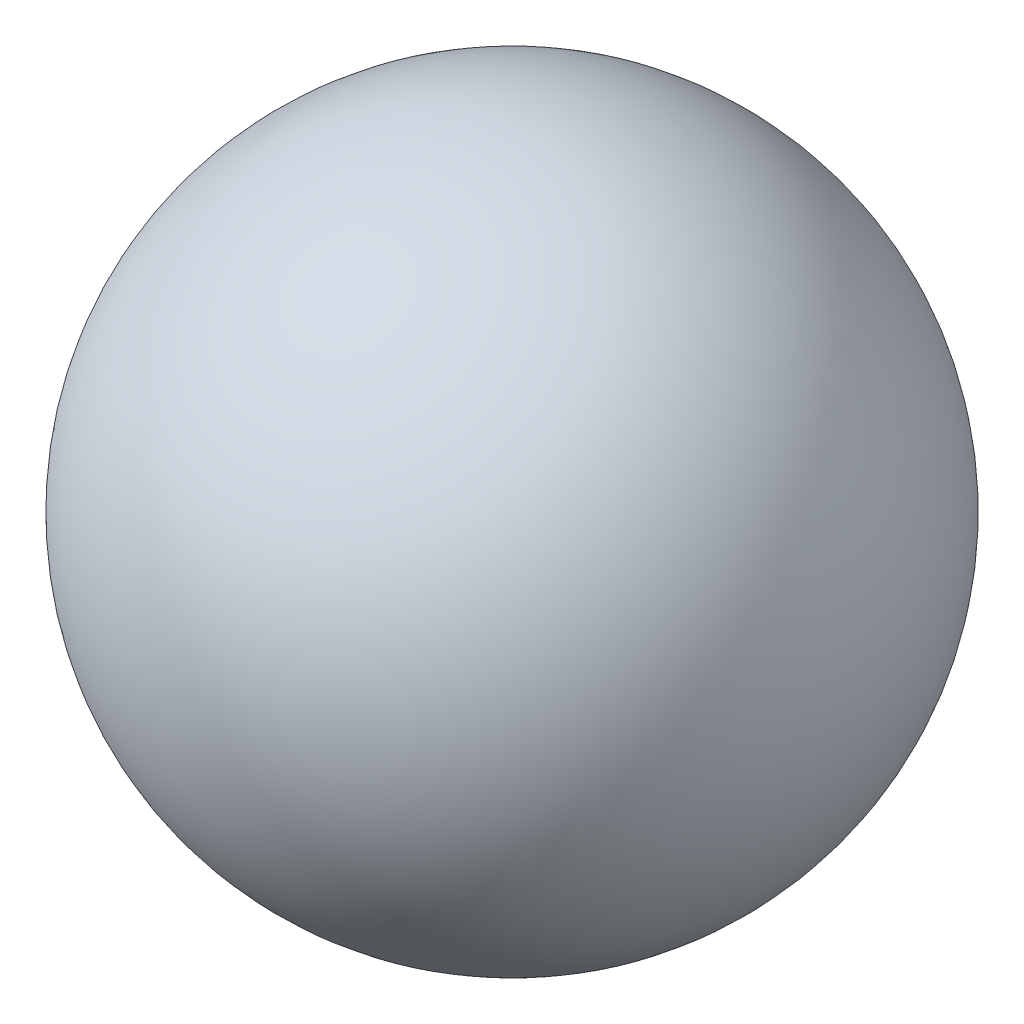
ISO-10303-21;
HEADER;
FILE_DESCRIPTION(('STEP AP214'),'2;1');
FILE_NAME('part.step','',(''),(''),'','','');
FILE_SCHEMA(('AUTOMOTIVE_DESIGN { 1 0 10303 214 1 1 1 1 }'));
ENDSEC;
DATA;
#1=APPLICATION_CONTEXT('core data for automotive mechanical design processes');
#2=APPLICATION_PROTOCOL_DEFINITION('international standard','automotive_design',2000,#1);
#3=PRODUCT_CONTEXT('',#1,'mechanical');
#4=PRODUCT('Part','Part','',(#3));
#5=PRODUCT_RELATED_PRODUCT_CATEGORY('part','',(#4));
#6=PRODUCT_DEFINITION_FORMATION('','',#4);
#7=PRODUCT_DEFINITION_CONTEXT('part definition',#1,'design');
#8=PRODUCT_DEFINITION('design','',#6,#7);
#9=PRODUCT_DEFINITION_SHAPE('','',#8);
#10=(LENGTH_UNIT() NAMED_UNIT(*) SI_UNIT(.MILLI.,.METRE.));
#11=(NAMED_UNIT(*) PLANE_ANGLE_UNIT() SI_UNIT($,.RADIAN.));
#12=(NAMED_UNIT(*) SI_UNIT($,.STERADIAN.) SOLID_ANGLE_UNIT());
#13=UNCERTAINTY_MEASURE_WITH_UNIT(LENGTH_MEASURE(1.E-05),#10,'distance_accuracy_value','');
#14=(GEOMETRIC_REPRESENTATION_CONTEXT(3) GLOBAL_UNCERTAINTY_ASSIGNED_CONTEXT((#13)) GLOBAL_UNIT_ASSIGNED_CONTEXT((#10,
#11,#12)) REPRESENTATION_CONTEXT('',''));
#15=CARTESIAN_POINT('',(0.,0.,0.));
#16=DIRECTION('',(0.,0.,1.));
#17=DIRECTION('',(1.,0.,0.));
#18=AXIS2_PLACEMENT_3D('',#15,#16,#17);
#19=CARTESIAN_POINT('',(0.,0.,0.));
#20=DIRECTION('',(0.,1.,0.));
#21=DIRECTION('',(1.,0.,0.));
#22=AXIS2_PLACEMENT_3D('',#19,#20,#21);
#23=SPHERICAL_SURFACE('',#22,2.49);
#24=CARTESIAN_POINT('',(0.,2.49,0.));
#25=VERTEX_POINT('',#24);
#26=VERTEX_LOOP('',#25);
#27=FACE_BOUND('',#26,.T.);
#28=ADVANCED_FACE('F39',(#27),#23,.T.);
#29=CLOSED_SHELL('',(#28));
#30=MANIFOLD_SOLID_BREP('B2',#29);
#31=ADVANCED_BREP_SHAPE_REPRESENTATION('',(#18,#30),#14);
#32=SHAPE_DEFINITION_REPRESENTATION(#9,#31);
ENDSEC;
END-ISO-10303-21;
